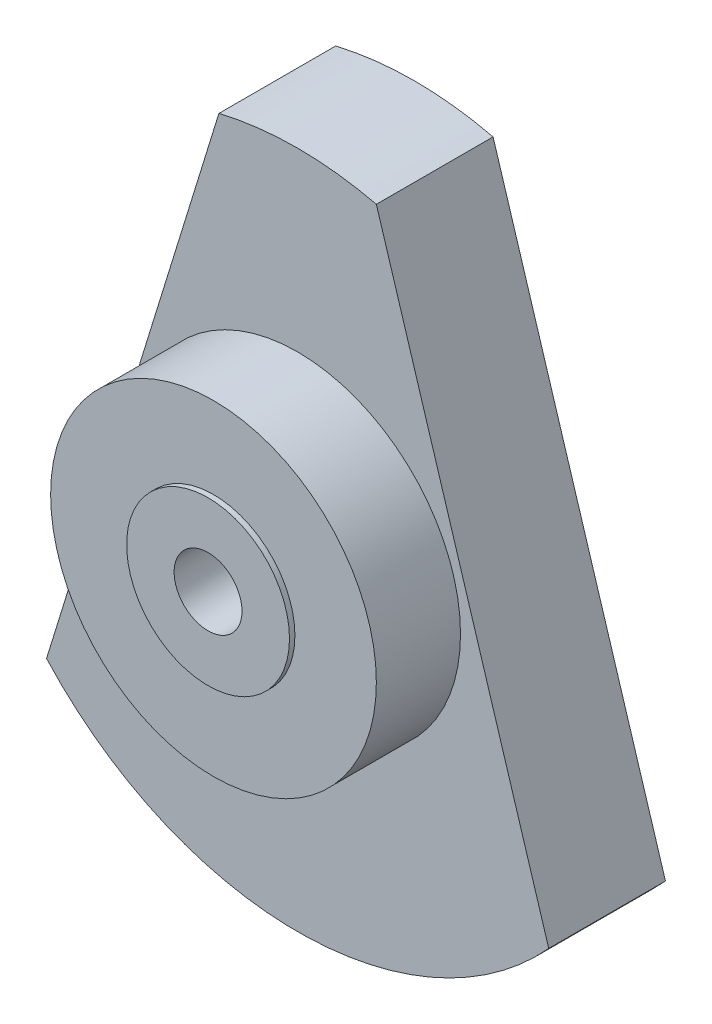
from build123d import *

# Parameters (mm, degrees)
BOSS_EXTRUDE1_DEPTH             = 4.3
SKETCH2_R                       = 6
BOSS_EXTRUDE2_DEPTH             = 3.1
SKETCH3_R                       = 3
BOSS_EXTRUDE3_DEPTH             = 0.2
M3X0_5_TAPPED_HOLE1_D           = 2.5
M3X0_5_TAPPED_HOLE1_DEPTH       = 6
M3X0_5_TAPPED_HOLE1_TIP         = 0.751075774
F_2_0MM_PRESS_DOWEL_HOLE1_D     = 2
F_2_0MM_PRESS_DOWEL_HOLE1_DEPTH = 3
F_2_0MM_PRESS_DOWEL_HOLE1_TIP   = 0.600860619


with BuildPart() as part:
    # Sketch1 → Boss-Extrude1 (new body)
    with BuildSketch(Plane.XY):
        with BuildLine():
            Line((-2.9, 12.158947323), (-9.25, -8.40758586))
            ThreePointArc((-9.25, -8.40758586), (0, -12.5), (9.25, -8.40758586))
            Line((9.25, -8.40758586), (2.9, 12.158947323))
            ThreePointArc((2.9, 12.158947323), (0, 12.5), (-2.9, 12.158947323))
        make_face()
    extrude(amount=-BOSS_EXTRUDE1_DEPTH)

    # Sketch2 → Boss-Extrude2 (add)
    with BuildSketch(Plane.XY):
        Circle(SKETCH2_R)
    extrude(amount=BOSS_EXTRUDE2_DEPTH)

    # Sketch3 → Boss-Extrude3 (add)
    with BuildSketch(Plane.XY.offset(3.1)):
        Circle(SKETCH3_R)
    extrude(amount=BOSS_EXTRUDE3_DEPTH)

    # M3x0.5 Tapped Hole1
    with Locations(Plane.XY.offset(3.3)):
        with Locations((0, 0)):
            Hole(M3X0_5_TAPPED_HOLE1_D / 2, depth=M3X0_5_TAPPED_HOLE1_DEPTH)
            with Locations((0, 0, -(M3X0_5_TAPPED_HOLE1_DEPTH + M3X0_5_TAPPED_HOLE1_TIP / 2))):  # 118° drill point
                Cone(0, M3X0_5_TAPPED_HOLE1_D / 2, M3X0_5_TAPPED_HOLE1_TIP, mode=Mode.SUBTRACT)

    # 2.0mm Press Dowel Hole1
    with Locations(Plane(origin=(0, 0, -4.3), x_dir=(-1, 0, 0), z_dir=(0, 0, -1))):
        with Locations((0, 9)):
            Hole(F_2_0MM_PRESS_DOWEL_HOLE1_D / 2, depth=F_2_0MM_PRESS_DOWEL_HOLE1_DEPTH)
            with Locations((0, 0, -(F_2_0MM_PRESS_DOWEL_HOLE1_DEPTH + F_2_0MM_PRESS_DOWEL_HOLE1_TIP / 2))):  # 118° drill point
                Cone(0, F_2_0MM_PRESS_DOWEL_HOLE1_D / 2, F_2_0MM_PRESS_DOWEL_HOLE1_TIP, mode=Mode.SUBTRACT)


solid = part.part
